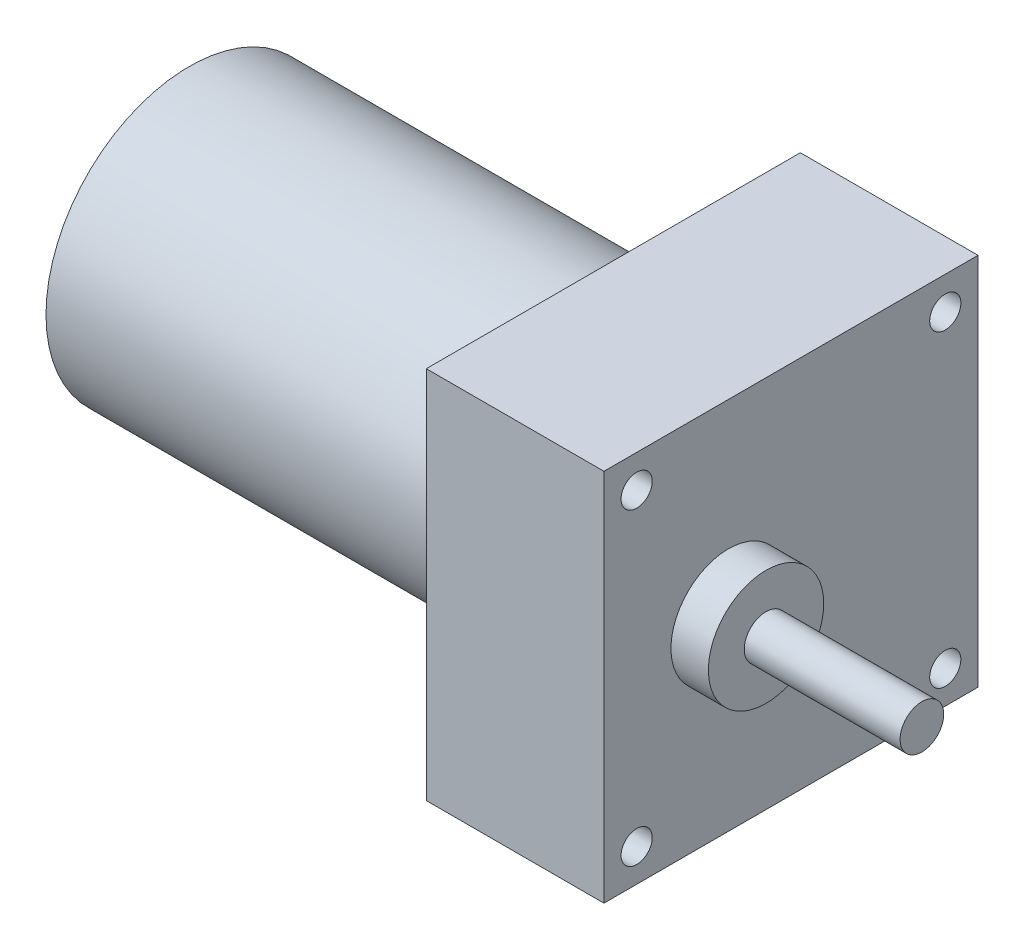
ISO-10303-21;
HEADER;
FILE_DESCRIPTION(('STEP AP214'),'2;1');
FILE_NAME('part.step','',(''),(''),'','','');
FILE_SCHEMA(('AUTOMOTIVE_DESIGN { 1 0 10303 214 1 1 1 1 }'));
ENDSEC;
DATA;
#1=APPLICATION_CONTEXT('core data for automotive mechanical design processes');
#2=APPLICATION_PROTOCOL_DEFINITION('international standard','automotive_design',2000,#1);
#3=PRODUCT_CONTEXT('',#1,'mechanical');
#4=PRODUCT('Part','Part','',(#3));
#5=PRODUCT_RELATED_PRODUCT_CATEGORY('part','',(#4));
#6=PRODUCT_DEFINITION_FORMATION('','',#4);
#7=PRODUCT_DEFINITION_CONTEXT('part definition',#1,'design');
#8=PRODUCT_DEFINITION('design','',#6,#7);
#9=PRODUCT_DEFINITION_SHAPE('','',#8);
#10=(LENGTH_UNIT() NAMED_UNIT(*) SI_UNIT(.MILLI.,.METRE.));
#11=(NAMED_UNIT(*) PLANE_ANGLE_UNIT() SI_UNIT($,.RADIAN.));
#12=(NAMED_UNIT(*) SI_UNIT($,.STERADIAN.) SOLID_ANGLE_UNIT());
#13=UNCERTAINTY_MEASURE_WITH_UNIT(LENGTH_MEASURE(1.E-05),#10,'distance_accuracy_value','');
#14=(GEOMETRIC_REPRESENTATION_CONTEXT(3) GLOBAL_UNCERTAINTY_ASSIGNED_CONTEXT((#13)) GLOBAL_UNIT_ASSIGNED_CONTEXT((#10,
#11,#12)) REPRESENTATION_CONTEXT('',''));
#15=CARTESIAN_POINT('',(0.,0.,0.));
#16=DIRECTION('',(0.,0.,1.));
#17=DIRECTION('',(1.,0.,0.));
#18=AXIS2_PLACEMENT_3D('',#15,#16,#17);
#19=CARTESIAN_POINT('',(59.5,0.,10.));
#20=DIRECTION('',(-1.,0.,0.));
#21=DIRECTION('',(0.,0.,1.));
#22=AXIS2_PLACEMENT_3D('',#19,#20,#21);
#23=CYLINDRICAL_SURFACE('',#22,3.5);
#24=CARTESIAN_POINT('',(59.5,0.,10.));
#25=DIRECTION('',(1.,0.,0.));
#26=DIRECTION('',(0.,0.,-1.));
#27=AXIS2_PLACEMENT_3D('',#24,#25,#26);
#28=CIRCLE('',#27,3.5);
#29=CARTESIAN_POINT('',(59.5,0.,6.5));
#30=VERTEX_POINT('',#29);
#31=EDGE_CURVE('E12',#30,#30,#28,.T.);
#32=ORIENTED_EDGE('',*,*,#31,.F.);
#33=EDGE_LOOP('',(#32));
#34=FACE_BOUND('',#33,.T.);
#35=CARTESIAN_POINT('',(34.5,0.,10.));
#36=DIRECTION('',(1.,0.,0.));
#37=DIRECTION('',(0.,0.,-1.));
#38=AXIS2_PLACEMENT_3D('',#35,#36,#37);
#39=CIRCLE('',#38,3.5);
#40=CARTESIAN_POINT('',(34.5,0.,6.5));
#41=VERTEX_POINT('',#40);
#42=EDGE_CURVE('E58',#41,#41,#39,.T.);
#43=ORIENTED_EDGE('',*,*,#42,.T.);
#44=EDGE_LOOP('',(#43));
#45=FACE_BOUND('',#44,.T.);
#46=ADVANCED_FACE('F55',(#34,#45),#23,.T.);
#47=CARTESIAN_POINT('',(59.5,0.,10.));
#48=DIRECTION('',(1.,0.,0.));
#49=DIRECTION('',(0.,0.,-1.));
#50=AXIS2_PLACEMENT_3D('',#47,#48,#49);
#51=PLANE('',#50);
#52=ORIENTED_EDGE('',*,*,#31,.T.);
#53=EDGE_LOOP('',(#52));
#54=FACE_BOUND('',#53,.T.);
#55=ADVANCED_FACE('F70',(#54),#51,.T.);
#56=CARTESIAN_POINT('',(34.5,0.,10.));
#57=DIRECTION('',(1.,0.,0.));
#58=DIRECTION('',(0.,0.,-1.));
#59=AXIS2_PLACEMENT_3D('',#56,#57,#58);
#60=PLANE('',#59);
#61=ORIENTED_EDGE('',*,*,#42,.F.);
#62=EDGE_LOOP('',(#61));
#63=FACE_BOUND('',#62,.T.);
#64=ADVANCED_FACE('F68',(#63),#60,.F.);
#65=CLOSED_SHELL('',(#46,#55,#64));
#66=MANIFOLD_SOLID_BREP('B2',#65);
#67=CARTESIAN_POINT('',(28.5,0.,-30.));
#68=DIRECTION('',(0.,0.,1.));
#69=DIRECTION('',(1.,0.,0.));
#70=AXIS2_PLACEMENT_3D('',#67,#68,#69);
#71=PLANE('',#70);
#72=DIRECTION('',(0.,1.,0.));
#73=VECTOR('',#72,1.);
#74=CARTESIAN_POINT('',(0.,0.,-30.));
#75=LINE('',#74,#73);
#76=CARTESIAN_POINT('',(0.,-30.,-30.));
#77=VERTEX_POINT('',#76);
#78=CARTESIAN_POINT('',(0.,30.,-30.));
#79=VERTEX_POINT('',#78);
#80=EDGE_CURVE('E178',#77,#79,#75,.T.);
#81=ORIENTED_EDGE('',*,*,#80,.T.);
#82=DIRECTION('',(-1.,0.,0.));
#83=VECTOR('',#82,1.);
#84=CARTESIAN_POINT('',(28.5,30.,-30.));
#85=LINE('',#84,#83);
#86=CARTESIAN_POINT('',(28.5,30.,-30.));
#87=VERTEX_POINT('',#86);
#88=EDGE_CURVE('E157',#87,#79,#85,.T.);
#89=ORIENTED_EDGE('',*,*,#88,.F.);
#90=DIRECTION('',(0.,1.,0.));
#91=VECTOR('',#90,1.);
#92=CARTESIAN_POINT('',(28.5,0.,-30.));
#93=LINE('',#92,#91);
#94=CARTESIAN_POINT('',(28.5,-30.,-30.));
#95=VERTEX_POINT('',#94);
#96=EDGE_CURVE('E148',#95,#87,#93,.T.);
#97=ORIENTED_EDGE('',*,*,#96,.F.);
#98=DIRECTION('',(-1.,0.,0.));
#99=VECTOR('',#98,1.);
#100=CARTESIAN_POINT('',(28.5,-30.,-30.));
#101=LINE('',#100,#99);
#102=EDGE_CURVE('E113',#95,#77,#101,.T.);
#103=ORIENTED_EDGE('',*,*,#102,.T.);
#104=EDGE_LOOP('',(#81,#89,#97,#103));
#105=FACE_BOUND('',#104,.T.);
#106=ADVANCED_FACE('F96',(#105),#71,.F.);
#107=CARTESIAN_POINT('',(28.5,30.,0.));
#108=DIRECTION('',(0.,-1.,0.));
#109=DIRECTION('',(0.,0.,-1.));
#110=AXIS2_PLACEMENT_3D('',#107,#108,#109);
#111=PLANE('',#110);
#112=DIRECTION('',(0.,0.,1.));
#113=VECTOR('',#112,1.);
#114=CARTESIAN_POINT('',(0.,30.,0.));
#115=LINE('',#114,#113);
#116=CARTESIAN_POINT('',(0.,30.,30.));
#117=VERTEX_POINT('',#116);
#118=EDGE_CURVE('E154',#79,#117,#115,.T.);
#119=ORIENTED_EDGE('',*,*,#118,.T.);
#120=DIRECTION('',(-1.,0.,0.));
#121=VECTOR('',#120,1.);
#122=CARTESIAN_POINT('',(28.5,30.,30.));
#123=LINE('',#122,#121);
#124=CARTESIAN_POINT('',(28.5,30.,30.));
#125=VERTEX_POINT('',#124);
#126=EDGE_CURVE('E152',#125,#117,#123,.T.);
#127=ORIENTED_EDGE('',*,*,#126,.F.);
#128=DIRECTION('',(0.,0.,1.));
#129=VECTOR('',#128,1.);
#130=CARTESIAN_POINT('',(28.5,30.,0.));
#131=LINE('',#130,#129);
#132=EDGE_CURVE('E139',#87,#125,#131,.T.);
#133=ORIENTED_EDGE('',*,*,#132,.F.);
#134=ORIENTED_EDGE('',*,*,#88,.T.);
#135=EDGE_LOOP('',(#119,#127,#133,#134));
#136=FACE_BOUND('',#135,.T.);
#137=ADVANCED_FACE('F153',(#136),#111,.F.);
#138=CARTESIAN_POINT('',(28.5,0.,30.));
#139=DIRECTION('',(0.,0.,1.));
#140=DIRECTION('',(1.,0.,0.));
#141=AXIS2_PLACEMENT_3D('',#138,#139,#140);
#142=PLANE('',#141);
#143=DIRECTION('',(0.,1.,0.));
#144=VECTOR('',#143,1.);
#145=CARTESIAN_POINT('',(0.,0.,30.));
#146=LINE('',#145,#144);
#147=CARTESIAN_POINT('',(0.,-30.,30.));
#148=VERTEX_POINT('',#147);
#149=EDGE_CURVE('E181',#148,#117,#146,.T.);
#150=ORIENTED_EDGE('',*,*,#149,.F.);
#151=DIRECTION('',(-1.,0.,0.));
#152=VECTOR('',#151,1.);
#153=CARTESIAN_POINT('',(28.5,-30.,30.));
#154=LINE('',#153,#152);
#155=CARTESIAN_POINT('',(28.5,-30.,30.));
#156=VERTEX_POINT('',#155);
#157=EDGE_CURVE('E127',#156,#148,#154,.T.);
#158=ORIENTED_EDGE('',*,*,#157,.F.);
#159=DIRECTION('',(0.,1.,0.));
#160=VECTOR('',#159,1.);
#161=CARTESIAN_POINT('',(28.5,0.,30.));
#162=LINE('',#161,#160);
#163=EDGE_CURVE('E147',#156,#125,#162,.T.);
#164=ORIENTED_EDGE('',*,*,#163,.T.);
#165=ORIENTED_EDGE('',*,*,#126,.T.);
#166=EDGE_LOOP('',(#150,#158,#164,#165));
#167=FACE_BOUND('',#166,.T.);
#168=ADVANCED_FACE('F159',(#167),#142,.T.);
#169=CARTESIAN_POINT('',(28.5,24.75,-24.75));
#170=DIRECTION('',(-1.,0.,0.));
#171=DIRECTION('',(0.,0.,1.));
#172=AXIS2_PLACEMENT_3D('',#169,#170,#171);
#173=CYLINDRICAL_SURFACE('',#172,2.5);
#174=CARTESIAN_POINT('',(28.5,24.75,-24.75));
#175=DIRECTION('',(1.,0.,0.));
#176=DIRECTION('',(0.,0.,-1.));
#177=AXIS2_PLACEMENT_3D('',#174,#175,#176);
#178=CIRCLE('',#177,2.5);
#179=CARTESIAN_POINT('',(28.5,24.75,-22.25));
#180=VERTEX_POINT('',#179);
#181=EDGE_CURVE('E162',#180,#180,#178,.T.);
#182=CARTESIAN_POINT('',(0.,24.75,-24.75));
#183=DIRECTION('',(1.,0.,0.));
#184=DIRECTION('',(0.,0.,-1.));
#185=AXIS2_PLACEMENT_3D('',#182,#183,#184);
#186=CIRCLE('',#185,2.5);
#187=CARTESIAN_POINT('',(0.,24.75,-22.25));
#188=VERTEX_POINT('',#187);
#189=EDGE_CURVE('E186',#188,#188,#186,.T.);
#190=CARTESIAN_POINT('',(28.5,24.75,-22.25));
#191=CARTESIAN_POINT('',(28.203125,24.75,-22.25));
#192=CARTESIAN_POINT('',(27.90625,24.75,-22.25));
#193=CARTESIAN_POINT('',(27.3125,24.75,-22.25));
#194=CARTESIAN_POINT('',(27.015625,24.75,-22.25));
#195=CARTESIAN_POINT('',(26.421875,24.75,-22.25));
#196=CARTESIAN_POINT('',(26.125,24.75,-22.25));
#197=CARTESIAN_POINT('',(25.53125,24.75,-22.25));
#198=CARTESIAN_POINT('',(25.234375,24.75,-22.25));
#199=CARTESIAN_POINT('',(24.640625,24.75,-22.25));
#200=CARTESIAN_POINT('',(24.34375,24.75,-22.25));
#201=CARTESIAN_POINT('',(23.75,24.75,-22.25));
#202=CARTESIAN_POINT('',(23.453125,24.75,-22.25));
#203=CARTESIAN_POINT('',(22.859375,24.75,-22.25));
#204=CARTESIAN_POINT('',(22.5625,24.75,-22.25));
#205=CARTESIAN_POINT('',(21.96875,24.75,-22.25));
#206=CARTESIAN_POINT('',(21.671875,24.75,-22.25));
#207=CARTESIAN_POINT('',(21.078125,24.75,-22.25));
#208=CARTESIAN_POINT('',(20.78125,24.75,-22.25));
#209=CARTESIAN_POINT('',(20.1875,24.75,-22.25));
#210=CARTESIAN_POINT('',(19.890625,24.75,-22.25));
#211=CARTESIAN_POINT('',(19.296875,24.75,-22.25));
#212=CARTESIAN_POINT('',(19.,24.75,-22.25));
#213=CARTESIAN_POINT('',(18.40625,24.75,-22.25));
#214=CARTESIAN_POINT('',(18.109375,24.75,-22.25));
#215=CARTESIAN_POINT('',(17.515625,24.75,-22.25));
#216=CARTESIAN_POINT('',(17.21875,24.75,-22.25));
#217=CARTESIAN_POINT('',(16.625,24.75,-22.25));
#218=CARTESIAN_POINT('',(16.328125,24.75,-22.25));
#219=CARTESIAN_POINT('',(15.734375,24.75,-22.25));
#220=CARTESIAN_POINT('',(15.4375,24.75,-22.25));
#221=CARTESIAN_POINT('',(14.84375,24.75,-22.25));
#222=CARTESIAN_POINT('',(14.546875,24.75,-22.25));
#223=CARTESIAN_POINT('',(13.953125,24.75,-22.25));
#224=CARTESIAN_POINT('',(13.65625,24.75,-22.25));
#225=CARTESIAN_POINT('',(13.0625,24.75,-22.25));
#226=CARTESIAN_POINT('',(12.765625,24.75,-22.25));
#227=CARTESIAN_POINT('',(12.171875,24.75,-22.25));
#228=CARTESIAN_POINT('',(11.875,24.75,-22.25));
#229=CARTESIAN_POINT('',(11.28125,24.75,-22.25));
#230=CARTESIAN_POINT('',(10.984375,24.75,-22.25));
#231=CARTESIAN_POINT('',(10.390625,24.75,-22.25));
#232=CARTESIAN_POINT('',(10.09375,24.75,-22.25));
#233=CARTESIAN_POINT('',(9.5,24.75,-22.25));
#234=CARTESIAN_POINT('',(9.203125,24.75,-22.25));
#235=CARTESIAN_POINT('',(8.609375,24.75,-22.25));
#236=CARTESIAN_POINT('',(8.3125,24.75,-22.25));
#237=CARTESIAN_POINT('',(7.71875,24.75,-22.25));
#238=CARTESIAN_POINT('',(7.421875,24.75,-22.25));
#239=CARTESIAN_POINT('',(6.828125,24.75,-22.25));
#240=CARTESIAN_POINT('',(6.53125,24.75,-22.25));
#241=CARTESIAN_POINT('',(5.9375,24.75,-22.25));
#242=CARTESIAN_POINT('',(5.640625,24.75,-22.25));
#243=CARTESIAN_POINT('',(5.046875,24.75,-22.25));
#244=CARTESIAN_POINT('',(4.75,24.75,-22.25));
#245=CARTESIAN_POINT('',(4.15625,24.75,-22.25));
#246=CARTESIAN_POINT('',(3.859375,24.75,-22.25));
#247=CARTESIAN_POINT('',(3.265625,24.75,-22.25));
#248=CARTESIAN_POINT('',(2.96875,24.75,-22.25));
#249=CARTESIAN_POINT('',(2.375,24.75,-22.25));
#250=CARTESIAN_POINT('',(2.078125,24.75,-22.25));
#251=CARTESIAN_POINT('',(1.484375,24.75,-22.25));
#252=CARTESIAN_POINT('',(1.1875,24.75,-22.25));
#253=CARTESIAN_POINT('',(0.593749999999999,24.75,-22.25));
#254=CARTESIAN_POINT('',(0.296875,24.75,-22.25));
#255=CARTESIAN_POINT('',(0.,24.75,-22.25));
#256=B_SPLINE_CURVE_WITH_KNOTS('',3,(#190,#191,#192,#193,#194,#195,#196,#197,#198,#199,#200,
#201,#202,#203,#204,#205,#206,#207,#208,#209,#210,#211,#212,#213,#214,#215,#216,#217,#218,#219,
#220,#221,#222,#223,#224,#225,#226,#227,#228,#229,#230,#231,#232,#233,#234,#235,#236,#237,#238,
#239,#240,#241,#242,#243,#244,#245,#246,#247,#248,#249,#250,#251,#252,#253,#254,#255),
.UNSPECIFIED.,.F.,.F.,(4,2,2,2,2,2,2,2,2,2,2,2,2,2,2,2,2,2,2,2,2,2,2,2,2,2,2,2,2,2,2,2,4),(0.,
0.890624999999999,1.78125,2.671875,3.5625,4.453125,5.34375,6.234375,7.125,8.015625,8.90625,
9.796875,10.6875,11.578125,12.46875,13.359375,14.25,15.140625,16.03125,16.921875,17.8125,
18.703125,19.59375,20.484375,21.375,22.265625,23.15625,24.046875,24.9375,25.828125,26.71875,
27.609375,28.5),.UNSPECIFIED.);
#257=EDGE_CURVE('BSEAM237',#180,#188,#256,.T.);
#258=ORIENTED_EDGE('',*,*,#181,.T.);
#259=ORIENTED_EDGE('',*,*,#189,.F.);
#260=ORIENTED_EDGE('',*,*,#257,.T.);
#261=ORIENTED_EDGE('',*,*,#257,.F.);
#262=EDGE_LOOP('',(#258,#260,#259,#261));
#263=FACE_BOUND('',#262,.T.);
#264=ADVANCED_FACE('F237',(#263),#173,.F.);
#265=CARTESIAN_POINT('',(28.5,-30.,0.));
#266=DIRECTION('',(0.,-1.,0.));
#267=DIRECTION('',(0.,0.,-1.));
#268=AXIS2_PLACEMENT_3D('',#265,#266,#267);
#269=PLANE('',#268);
#270=DIRECTION('',(0.,0.,1.));
#271=VECTOR('',#270,1.);
#272=CARTESIAN_POINT('',(0.,-30.,0.));
#273=LINE('',#272,#271);
#274=EDGE_CURVE('E183',#77,#148,#273,.T.);
#275=ORIENTED_EDGE('',*,*,#274,.F.);
#276=ORIENTED_EDGE('',*,*,#102,.F.);
#277=DIRECTION('',(0.,0.,1.));
#278=VECTOR('',#277,1.);
#279=CARTESIAN_POINT('',(28.5,-30.,0.));
#280=LINE('',#279,#278);
#281=EDGE_CURVE('E160',#95,#156,#280,.T.);
#282=ORIENTED_EDGE('',*,*,#281,.T.);
#283=ORIENTED_EDGE('',*,*,#157,.T.);
#284=EDGE_LOOP('',(#275,#276,#282,#283));
#285=FACE_BOUND('',#284,.T.);
#286=ADVANCED_FACE('F230',(#285),#269,.T.);
#287=CARTESIAN_POINT('',(28.5,-24.75,24.75));
#288=DIRECTION('',(-1.,0.,0.));
#289=DIRECTION('',(0.,0.,1.));
#290=AXIS2_PLACEMENT_3D('',#287,#288,#289);
#291=CYLINDRICAL_SURFACE('',#290,2.5);
#292=CARTESIAN_POINT('',(28.5,-24.75,24.75));
#293=DIRECTION('',(1.,0.,0.));
#294=DIRECTION('',(0.,0.,-1.));
#295=AXIS2_PLACEMENT_3D('',#292,#293,#294);
#296=CIRCLE('',#295,2.5);
#297=CARTESIAN_POINT('',(28.5,-24.75,27.25));
#298=VERTEX_POINT('',#297);
#299=EDGE_CURVE('E242',#298,#298,#296,.T.);
#300=CARTESIAN_POINT('',(0.,-24.75,24.75));
#301=DIRECTION('',(1.,0.,0.));
#302=DIRECTION('',(0.,0.,-1.));
#303=AXIS2_PLACEMENT_3D('',#300,#301,#302);
#304=CIRCLE('',#303,2.5);
#305=CARTESIAN_POINT('',(0.,-24.75,27.25));
#306=VERTEX_POINT('',#305);
#307=EDGE_CURVE('E174',#306,#306,#304,.T.);
#308=CARTESIAN_POINT('',(28.5,-24.75,27.25));
#309=CARTESIAN_POINT('',(28.203125,-24.75,27.25));
#310=CARTESIAN_POINT('',(27.90625,-24.75,27.25));
#311=CARTESIAN_POINT('',(27.3125,-24.75,27.25));
#312=CARTESIAN_POINT('',(27.015625,-24.75,27.25));
#313=CARTESIAN_POINT('',(26.421875,-24.75,27.25));
#314=CARTESIAN_POINT('',(26.125,-24.75,27.25));
#315=CARTESIAN_POINT('',(25.53125,-24.75,27.25));
#316=CARTESIAN_POINT('',(25.234375,-24.75,27.25));
#317=CARTESIAN_POINT('',(24.640625,-24.75,27.25));
#318=CARTESIAN_POINT('',(24.34375,-24.75,27.25));
#319=CARTESIAN_POINT('',(23.75,-24.75,27.25));
#320=CARTESIAN_POINT('',(23.453125,-24.75,27.25));
#321=CARTESIAN_POINT('',(22.859375,-24.75,27.25));
#322=CARTESIAN_POINT('',(22.5625,-24.75,27.25));
#323=CARTESIAN_POINT('',(21.96875,-24.75,27.25));
#324=CARTESIAN_POINT('',(21.671875,-24.75,27.25));
#325=CARTESIAN_POINT('',(21.078125,-24.75,27.25));
#326=CARTESIAN_POINT('',(20.78125,-24.75,27.25));
#327=CARTESIAN_POINT('',(20.1875,-24.75,27.25));
#328=CARTESIAN_POINT('',(19.890625,-24.75,27.25));
#329=CARTESIAN_POINT('',(19.296875,-24.75,27.25));
#330=CARTESIAN_POINT('',(19.,-24.75,27.25));
#331=CARTESIAN_POINT('',(18.40625,-24.75,27.25));
#332=CARTESIAN_POINT('',(18.109375,-24.75,27.25));
#333=CARTESIAN_POINT('',(17.515625,-24.75,27.25));
#334=CARTESIAN_POINT('',(17.21875,-24.75,27.25));
#335=CARTESIAN_POINT('',(16.625,-24.75,27.25));
#336=CARTESIAN_POINT('',(16.328125,-24.75,27.25));
#337=CARTESIAN_POINT('',(15.734375,-24.75,27.25));
#338=CARTESIAN_POINT('',(15.4375,-24.75,27.25));
#339=CARTESIAN_POINT('',(14.84375,-24.75,27.25));
#340=CARTESIAN_POINT('',(14.546875,-24.75,27.25));
#341=CARTESIAN_POINT('',(13.953125,-24.75,27.25));
#342=CARTESIAN_POINT('',(13.65625,-24.75,27.25));
#343=CARTESIAN_POINT('',(13.0625,-24.75,27.25));
#344=CARTESIAN_POINT('',(12.765625,-24.75,27.25));
#345=CARTESIAN_POINT('',(12.171875,-24.75,27.25));
#346=CARTESIAN_POINT('',(11.875,-24.75,27.25));
#347=CARTESIAN_POINT('',(11.28125,-24.75,27.25));
#348=CARTESIAN_POINT('',(10.984375,-24.75,27.25));
#349=CARTESIAN_POINT('',(10.390625,-24.75,27.25));
#350=CARTESIAN_POINT('',(10.09375,-24.75,27.25));
#351=CARTESIAN_POINT('',(9.5,-24.75,27.25));
#352=CARTESIAN_POINT('',(9.203125,-24.75,27.25));
#353=CARTESIAN_POINT('',(8.609375,-24.75,27.25));
#354=CARTESIAN_POINT('',(8.3125,-24.75,27.25));
#355=CARTESIAN_POINT('',(7.71875,-24.75,27.25));
#356=CARTESIAN_POINT('',(7.421875,-24.75,27.25));
#357=CARTESIAN_POINT('',(6.828125,-24.75,27.25));
#358=CARTESIAN_POINT('',(6.53125,-24.75,27.25));
#359=CARTESIAN_POINT('',(5.9375,-24.75,27.25));
#360=CARTESIAN_POINT('',(5.640625,-24.75,27.25));
#361=CARTESIAN_POINT('',(5.046875,-24.75,27.25));
#362=CARTESIAN_POINT('',(4.75,-24.75,27.25));
#363=CARTESIAN_POINT('',(4.15625,-24.75,27.25));
#364=CARTESIAN_POINT('',(3.859375,-24.75,27.25));
#365=CARTESIAN_POINT('',(3.265625,-24.75,27.25));
#366=CARTESIAN_POINT('',(2.96875,-24.75,27.25));
#367=CARTESIAN_POINT('',(2.375,-24.75,27.25));
#368=CARTESIAN_POINT('',(2.078125,-24.75,27.25));
#369=CARTESIAN_POINT('',(1.484375,-24.75,27.25));
#370=CARTESIAN_POINT('',(1.1875,-24.75,27.25));
#371=CARTESIAN_POINT('',(0.593749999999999,-24.75,27.25));
#372=CARTESIAN_POINT('',(0.296875,-24.75,27.25));
#373=CARTESIAN_POINT('',(0.,-24.75,27.25));
#374=B_SPLINE_CURVE_WITH_KNOTS('',3,(#308,#309,#310,#311,#312,#313,#314,#315,#316,#317,#318,
#319,#320,#321,#322,#323,#324,#325,#326,#327,#328,#329,#330,#331,#332,#333,#334,#335,#336,#337,
#338,#339,#340,#341,#342,#343,#344,#345,#346,#347,#348,#349,#350,#351,#352,#353,#354,#355,#356,
#357,#358,#359,#360,#361,#362,#363,#364,#365,#366,#367,#368,#369,#370,#371,#372,#373),
.UNSPECIFIED.,.F.,.F.,(4,2,2,2,2,2,2,2,2,2,2,2,2,2,2,2,2,2,2,2,2,2,2,2,2,2,2,2,2,2,2,2,4),(0.,
0.890624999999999,1.78125,2.671875,3.5625,4.453125,5.34375,6.234375,7.125,8.015625,8.90625,
9.796875,10.6875,11.578125,12.46875,13.359375,14.25,15.140625,16.03125,16.921875,17.8125,
18.703125,19.59375,20.484375,21.375,22.265625,23.15625,24.046875,24.9375,25.828125,26.71875,
27.609375,28.5),.UNSPECIFIED.);
#375=EDGE_CURVE('BSEAM228',#298,#306,#374,.T.);
#376=ORIENTED_EDGE('',*,*,#299,.T.);
#377=ORIENTED_EDGE('',*,*,#307,.F.);
#378=ORIENTED_EDGE('',*,*,#375,.T.);
#379=ORIENTED_EDGE('',*,*,#375,.F.);
#380=EDGE_LOOP('',(#376,#378,#377,#379));
#381=FACE_BOUND('',#380,.T.);
#382=ADVANCED_FACE('F228',(#381),#291,.F.);
#383=CARTESIAN_POINT('',(28.5,24.75,24.75));
#384=DIRECTION('',(-1.,0.,0.));
#385=DIRECTION('',(0.,0.,1.));
#386=AXIS2_PLACEMENT_3D('',#383,#384,#385);
#387=CYLINDRICAL_SURFACE('',#386,2.5);
#388=CARTESIAN_POINT('',(28.5,24.75,24.75));
#389=DIRECTION('',(1.,0.,0.));
#390=DIRECTION('',(0.,0.,-1.));
#391=AXIS2_PLACEMENT_3D('',#388,#389,#390);
#392=CIRCLE('',#391,2.5);
#393=CARTESIAN_POINT('',(28.5,24.75,27.25));
#394=VERTEX_POINT('',#393);
#395=EDGE_CURVE('E192',#394,#394,#392,.F.);
#396=CARTESIAN_POINT('',(0.,24.75,24.75));
#397=DIRECTION('',(1.,0.,0.));
#398=DIRECTION('',(0.,0.,-1.));
#399=AXIS2_PLACEMENT_3D('',#396,#397,#398);
#400=CIRCLE('',#399,2.5);
#401=CARTESIAN_POINT('',(0.,24.75,27.25));
#402=VERTEX_POINT('',#401);
#403=EDGE_CURVE('E171',#402,#402,#400,.F.);
#404=CARTESIAN_POINT('',(28.5,24.75,27.25));
#405=CARTESIAN_POINT('',(28.203125,24.75,27.25));
#406=CARTESIAN_POINT('',(27.90625,24.75,27.25));
#407=CARTESIAN_POINT('',(27.3125,24.75,27.25));
#408=CARTESIAN_POINT('',(27.015625,24.75,27.25));
#409=CARTESIAN_POINT('',(26.421875,24.75,27.25));
#410=CARTESIAN_POINT('',(26.125,24.75,27.25));
#411=CARTESIAN_POINT('',(25.53125,24.75,27.25));
#412=CARTESIAN_POINT('',(25.234375,24.75,27.25));
#413=CARTESIAN_POINT('',(24.640625,24.75,27.25));
#414=CARTESIAN_POINT('',(24.34375,24.75,27.25));
#415=CARTESIAN_POINT('',(23.75,24.75,27.25));
#416=CARTESIAN_POINT('',(23.453125,24.75,27.25));
#417=CARTESIAN_POINT('',(22.859375,24.75,27.25));
#418=CARTESIAN_POINT('',(22.5625,24.75,27.25));
#419=CARTESIAN_POINT('',(21.96875,24.75,27.25));
#420=CARTESIAN_POINT('',(21.671875,24.75,27.25));
#421=CARTESIAN_POINT('',(21.078125,24.75,27.25));
#422=CARTESIAN_POINT('',(20.78125,24.75,27.25));
#423=CARTESIAN_POINT('',(20.1875,24.75,27.25));
#424=CARTESIAN_POINT('',(19.890625,24.75,27.25));
#425=CARTESIAN_POINT('',(19.296875,24.75,27.25));
#426=CARTESIAN_POINT('',(19.,24.75,27.25));
#427=CARTESIAN_POINT('',(18.40625,24.75,27.25));
#428=CARTESIAN_POINT('',(18.109375,24.75,27.25));
#429=CARTESIAN_POINT('',(17.515625,24.75,27.25));
#430=CARTESIAN_POINT('',(17.21875,24.75,27.25));
#431=CARTESIAN_POINT('',(16.625,24.75,27.25));
#432=CARTESIAN_POINT('',(16.328125,24.75,27.25));
#433=CARTESIAN_POINT('',(15.734375,24.75,27.25));
#434=CARTESIAN_POINT('',(15.4375,24.75,27.25));
#435=CARTESIAN_POINT('',(14.84375,24.75,27.25));
#436=CARTESIAN_POINT('',(14.546875,24.75,27.25));
#437=CARTESIAN_POINT('',(13.953125,24.75,27.25));
#438=CARTESIAN_POINT('',(13.65625,24.75,27.25));
#439=CARTESIAN_POINT('',(13.0625,24.75,27.25));
#440=CARTESIAN_POINT('',(12.765625,24.75,27.25));
#441=CARTESIAN_POINT('',(12.171875,24.75,27.25));
#442=CARTESIAN_POINT('',(11.875,24.75,27.25));
#443=CARTESIAN_POINT('',(11.28125,24.75,27.25));
#444=CARTESIAN_POINT('',(10.984375,24.75,27.25));
#445=CARTESIAN_POINT('',(10.390625,24.75,27.25));
#446=CARTESIAN_POINT('',(10.09375,24.75,27.25));
#447=CARTESIAN_POINT('',(9.5,24.75,27.25));
#448=CARTESIAN_POINT('',(9.203125,24.75,27.25));
#449=CARTESIAN_POINT('',(8.609375,24.75,27.25));
#450=CARTESIAN_POINT('',(8.3125,24.75,27.25));
#451=CARTESIAN_POINT('',(7.71875,24.75,27.25));
#452=CARTESIAN_POINT('',(7.421875,24.75,27.25));
#453=CARTESIAN_POINT('',(6.828125,24.75,27.25));
#454=CARTESIAN_POINT('',(6.53125,24.75,27.25));
#455=CARTESIAN_POINT('',(5.9375,24.75,27.25));
#456=CARTESIAN_POINT('',(5.640625,24.75,27.25));
#457=CARTESIAN_POINT('',(5.046875,24.75,27.25));
#458=CARTESIAN_POINT('',(4.75,24.75,27.25));
#459=CARTESIAN_POINT('',(4.15625,24.75,27.25));
#460=CARTESIAN_POINT('',(3.859375,24.75,27.25));
#461=CARTESIAN_POINT('',(3.265625,24.75,27.25));
#462=CARTESIAN_POINT('',(2.96875,24.75,27.25));
#463=CARTESIAN_POINT('',(2.375,24.75,27.25));
#464=CARTESIAN_POINT('',(2.078125,24.75,27.25));
#465=CARTESIAN_POINT('',(1.484375,24.75,27.25));
#466=CARTESIAN_POINT('',(1.1875,24.75,27.25));
#467=CARTESIAN_POINT('',(0.593749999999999,24.75,27.25));
#468=CARTESIAN_POINT('',(0.296875,24.75,27.25));
#469=CARTESIAN_POINT('',(0.,24.75,27.25));
#470=B_SPLINE_CURVE_WITH_KNOTS('',3,(#404,#405,#406,#407,#408,#409,#410,#411,#412,#413,#414,
#415,#416,#417,#418,#419,#420,#421,#422,#423,#424,#425,#426,#427,#428,#429,#430,#431,#432,#433,
#434,#435,#436,#437,#438,#439,#440,#441,#442,#443,#444,#445,#446,#447,#448,#449,#450,#451,#452,
#453,#454,#455,#456,#457,#458,#459,#460,#461,#462,#463,#464,#465,#466,#467,#468,#469),
.UNSPECIFIED.,.F.,.F.,(4,2,2,2,2,2,2,2,2,2,2,2,2,2,2,2,2,2,2,2,2,2,2,2,2,2,2,2,2,2,2,2,4),(0.,
0.890624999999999,1.78125,2.671875,3.5625,4.453125,5.34375,6.234375,7.125,8.015625,8.90625,
9.796875,10.6875,11.578125,12.46875,13.359375,14.25,15.140625,16.03125,16.921875,17.8125,
18.703125,19.59375,20.484375,21.375,22.265625,23.15625,24.046875,24.9375,25.828125,26.71875,
27.609375,28.5),.UNSPECIFIED.);
#471=EDGE_CURVE('BSEAM98',#394,#402,#470,.T.);
#472=ORIENTED_EDGE('',*,*,#395,.F.);
#473=ORIENTED_EDGE('',*,*,#403,.T.);
#474=ORIENTED_EDGE('',*,*,#471,.T.);
#475=ORIENTED_EDGE('',*,*,#471,.F.);
#476=EDGE_LOOP('',(#472,#474,#473,#475));
#477=FACE_BOUND('',#476,.T.);
#478=ADVANCED_FACE('F98',(#477),#387,.F.);
#479=CARTESIAN_POINT('',(28.5,-24.75,-24.75));
#480=DIRECTION('',(-1.,0.,0.));
#481=DIRECTION('',(0.,0.,1.));
#482=AXIS2_PLACEMENT_3D('',#479,#480,#481);
#483=CYLINDRICAL_SURFACE('',#482,2.5);
#484=CARTESIAN_POINT('',(28.5,-24.75,-24.75));
#485=DIRECTION('',(1.,0.,0.));
#486=DIRECTION('',(0.,0.,-1.));
#487=AXIS2_PLACEMENT_3D('',#484,#485,#486);
#488=CIRCLE('',#487,2.5);
#489=CARTESIAN_POINT('',(28.5,-24.75,-22.25));
#490=VERTEX_POINT('',#489);
#491=EDGE_CURVE('E168',#490,#490,#488,.F.);
#492=CARTESIAN_POINT('',(0.,-24.75,-24.75));
#493=DIRECTION('',(1.,0.,0.));
#494=DIRECTION('',(0.,0.,-1.));
#495=AXIS2_PLACEMENT_3D('',#492,#493,#494);
#496=CIRCLE('',#495,2.5);
#497=CARTESIAN_POINT('',(0.,-24.75,-22.25));
#498=VERTEX_POINT('',#497);
#499=EDGE_CURVE('E189',#498,#498,#496,.F.);
#500=CARTESIAN_POINT('',(28.5,-24.75,-22.25));
#501=CARTESIAN_POINT('',(28.203125,-24.75,-22.25));
#502=CARTESIAN_POINT('',(27.90625,-24.75,-22.25));
#503=CARTESIAN_POINT('',(27.3125,-24.75,-22.25));
#504=CARTESIAN_POINT('',(27.015625,-24.75,-22.25));
#505=CARTESIAN_POINT('',(26.421875,-24.75,-22.25));
#506=CARTESIAN_POINT('',(26.125,-24.75,-22.25));
#507=CARTESIAN_POINT('',(25.53125,-24.75,-22.25));
#508=CARTESIAN_POINT('',(25.234375,-24.75,-22.25));
#509=CARTESIAN_POINT('',(24.640625,-24.75,-22.25));
#510=CARTESIAN_POINT('',(24.34375,-24.75,-22.25));
#511=CARTESIAN_POINT('',(23.75,-24.75,-22.25));
#512=CARTESIAN_POINT('',(23.453125,-24.75,-22.25));
#513=CARTESIAN_POINT('',(22.859375,-24.75,-22.25));
#514=CARTESIAN_POINT('',(22.5625,-24.75,-22.25));
#515=CARTESIAN_POINT('',(21.96875,-24.75,-22.25));
#516=CARTESIAN_POINT('',(21.671875,-24.75,-22.25));
#517=CARTESIAN_POINT('',(21.078125,-24.75,-22.25));
#518=CARTESIAN_POINT('',(20.78125,-24.75,-22.25));
#519=CARTESIAN_POINT('',(20.1875,-24.75,-22.25));
#520=CARTESIAN_POINT('',(19.890625,-24.75,-22.25));
#521=CARTESIAN_POINT('',(19.296875,-24.75,-22.25));
#522=CARTESIAN_POINT('',(19.,-24.75,-22.25));
#523=CARTESIAN_POINT('',(18.40625,-24.75,-22.25));
#524=CARTESIAN_POINT('',(18.109375,-24.75,-22.25));
#525=CARTESIAN_POINT('',(17.515625,-24.75,-22.25));
#526=CARTESIAN_POINT('',(17.21875,-24.75,-22.25));
#527=CARTESIAN_POINT('',(16.625,-24.75,-22.25));
#528=CARTESIAN_POINT('',(16.328125,-24.75,-22.25));
#529=CARTESIAN_POINT('',(15.734375,-24.75,-22.25));
#530=CARTESIAN_POINT('',(15.4375,-24.75,-22.25));
#531=CARTESIAN_POINT('',(14.84375,-24.75,-22.25));
#532=CARTESIAN_POINT('',(14.546875,-24.75,-22.25));
#533=CARTESIAN_POINT('',(13.953125,-24.75,-22.25));
#534=CARTESIAN_POINT('',(13.65625,-24.75,-22.25));
#535=CARTESIAN_POINT('',(13.0625,-24.75,-22.25));
#536=CARTESIAN_POINT('',(12.765625,-24.75,-22.25));
#537=CARTESIAN_POINT('',(12.171875,-24.75,-22.25));
#538=CARTESIAN_POINT('',(11.875,-24.75,-22.25));
#539=CARTESIAN_POINT('',(11.28125,-24.75,-22.25));
#540=CARTESIAN_POINT('',(10.984375,-24.75,-22.25));
#541=CARTESIAN_POINT('',(10.390625,-24.75,-22.25));
#542=CARTESIAN_POINT('',(10.09375,-24.75,-22.25));
#543=CARTESIAN_POINT('',(9.5,-24.75,-22.25));
#544=CARTESIAN_POINT('',(9.203125,-24.75,-22.25));
#545=CARTESIAN_POINT('',(8.609375,-24.75,-22.25));
#546=CARTESIAN_POINT('',(8.3125,-24.75,-22.25));
#547=CARTESIAN_POINT('',(7.71875,-24.75,-22.25));
#548=CARTESIAN_POINT('',(7.421875,-24.75,-22.25));
#549=CARTESIAN_POINT('',(6.828125,-24.75,-22.25));
#550=CARTESIAN_POINT('',(6.53125,-24.75,-22.25));
#551=CARTESIAN_POINT('',(5.9375,-24.75,-22.25));
#552=CARTESIAN_POINT('',(5.640625,-24.75,-22.25));
#553=CARTESIAN_POINT('',(5.046875,-24.75,-22.25));
#554=CARTESIAN_POINT('',(4.75,-24.75,-22.25));
#555=CARTESIAN_POINT('',(4.15625,-24.75,-22.25));
#556=CARTESIAN_POINT('',(3.859375,-24.75,-22.25));
#557=CARTESIAN_POINT('',(3.265625,-24.75,-22.25));
#558=CARTESIAN_POINT('',(2.96875,-24.75,-22.25));
#559=CARTESIAN_POINT('',(2.375,-24.75,-22.25));
#560=CARTESIAN_POINT('',(2.078125,-24.75,-22.25));
#561=CARTESIAN_POINT('',(1.484375,-24.75,-22.25));
#562=CARTESIAN_POINT('',(1.1875,-24.75,-22.25));
#563=CARTESIAN_POINT('',(0.593749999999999,-24.75,-22.25));
#564=CARTESIAN_POINT('',(0.296875,-24.75,-22.25));
#565=CARTESIAN_POINT('',(0.,-24.75,-22.25));
#566=B_SPLINE_CURVE_WITH_KNOTS('',3,(#500,#501,#502,#503,#504,#505,#506,#507,#508,#509,#510,
#511,#512,#513,#514,#515,#516,#517,#518,#519,#520,#521,#522,#523,#524,#525,#526,#527,#528,#529,
#530,#531,#532,#533,#534,#535,#536,#537,#538,#539,#540,#541,#542,#543,#544,#545,#546,#547,#548,
#549,#550,#551,#552,#553,#554,#555,#556,#557,#558,#559,#560,#561,#562,#563,#564,#565),
.UNSPECIFIED.,.F.,.F.,(4,2,2,2,2,2,2,2,2,2,2,2,2,2,2,2,2,2,2,2,2,2,2,2,2,2,2,2,2,2,2,2,4),(0.,
0.890624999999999,1.78125,2.671875,3.5625,4.453125,5.34375,6.234375,7.125,8.015625,8.90625,
9.796875,10.6875,11.578125,12.46875,13.359375,14.25,15.140625,16.03125,16.921875,17.8125,
18.703125,19.59375,20.484375,21.375,22.265625,23.15625,24.046875,24.9375,25.828125,26.71875,
27.609375,28.5),.UNSPECIFIED.);
#567=EDGE_CURVE('BSEAM219',#490,#498,#566,.T.);
#568=ORIENTED_EDGE('',*,*,#491,.F.);
#569=ORIENTED_EDGE('',*,*,#499,.T.);
#570=ORIENTED_EDGE('',*,*,#567,.T.);
#571=ORIENTED_EDGE('',*,*,#567,.F.);
#572=EDGE_LOOP('',(#568,#570,#569,#571));
#573=FACE_BOUND('',#572,.T.);
#574=ADVANCED_FACE('F219',(#573),#483,.F.);
#575=CARTESIAN_POINT('',(28.5,0.,0.));
#576=DIRECTION('',(1.,0.,0.));
#577=DIRECTION('',(0.,0.,-1.));
#578=AXIS2_PLACEMENT_3D('',#575,#576,#577);
#579=PLANE('',#578);
#580=CARTESIAN_POINT('',(28.5,0.,10.));
#581=DIRECTION('',(1.,0.,0.));
#582=DIRECTION('',(0.,0.,-1.));
#583=AXIS2_PLACEMENT_3D('',#580,#581,#582);
#584=CIRCLE('',#583,9.25);
#585=CARTESIAN_POINT('',(28.5,0.,0.750000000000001));
#586=VERTEX_POINT('',#585);
#587=EDGE_CURVE('E358',#586,#586,#584,.T.);
#588=ORIENTED_EDGE('',*,*,#587,.F.);
#589=EDGE_LOOP('',(#588));
#590=FACE_BOUND('',#589,.T.);
#591=ORIENTED_EDGE('',*,*,#395,.T.);
#592=EDGE_LOOP('',(#591));
#593=FACE_BOUND('',#592,.T.);
#594=ORIENTED_EDGE('',*,*,#299,.F.);
#595=EDGE_LOOP('',(#594));
#596=FACE_BOUND('',#595,.T.);
#597=ORIENTED_EDGE('',*,*,#96,.T.);
#598=ORIENTED_EDGE('',*,*,#132,.T.);
#599=ORIENTED_EDGE('',*,*,#163,.F.);
#600=ORIENTED_EDGE('',*,*,#281,.F.);
#601=EDGE_LOOP('',(#597,#598,#599,#600));
#602=FACE_BOUND('',#601,.T.);
#603=ORIENTED_EDGE('',*,*,#181,.F.);
#604=EDGE_LOOP('',(#603));
#605=FACE_BOUND('',#604,.T.);
#606=ORIENTED_EDGE('',*,*,#491,.T.);
#607=EDGE_LOOP('',(#606));
#608=FACE_BOUND('',#607,.T.);
#609=ADVANCED_FACE('F143',(#590,#593,#596,#602,#605,#608),#579,.T.);
#610=CARTESIAN_POINT('',(0.,0.,0.));
#611=DIRECTION('',(1.,0.,0.));
#612=DIRECTION('',(0.,0.,-1.));
#613=AXIS2_PLACEMENT_3D('',#610,#611,#612);
#614=PLANE('',#613);
#615=CARTESIAN_POINT('',(0.,0.,0.));
#616=DIRECTION('',(1.,0.,0.));
#617=DIRECTION('',(0.,0.,-1.));
#618=AXIS2_PLACEMENT_3D('',#615,#616,#617);
#619=CIRCLE('',#618,23.);
#620=CARTESIAN_POINT('',(0.,0.,-23.));
#621=VERTEX_POINT('',#620);
#622=EDGE_CURVE('E53',#621,#621,#619,.F.);
#623=ORIENTED_EDGE('',*,*,#622,.F.);
#624=EDGE_LOOP('',(#623));
#625=FACE_BOUND('',#624,.T.);
#626=ORIENTED_EDGE('',*,*,#403,.F.);
#627=EDGE_LOOP('',(#626));
#628=FACE_BOUND('',#627,.T.);
#629=ORIENTED_EDGE('',*,*,#307,.T.);
#630=EDGE_LOOP('',(#629));
#631=FACE_BOUND('',#630,.T.);
#632=ORIENTED_EDGE('',*,*,#80,.F.);
#633=ORIENTED_EDGE('',*,*,#274,.T.);
#634=ORIENTED_EDGE('',*,*,#149,.T.);
#635=ORIENTED_EDGE('',*,*,#118,.F.);
#636=EDGE_LOOP('',(#632,#633,#634,#635));
#637=FACE_BOUND('',#636,.T.);
#638=ORIENTED_EDGE('',*,*,#189,.T.);
#639=EDGE_LOOP('',(#638));
#640=FACE_BOUND('',#639,.T.);
#641=ORIENTED_EDGE('',*,*,#499,.F.);
#642=EDGE_LOOP('',(#641));
#643=FACE_BOUND('',#642,.T.);
#644=ADVANCED_FACE('F218',(#625,#628,#631,#637,#640,#643),#614,.F.);
#645=CARTESIAN_POINT('',(34.5,0.,10.));
#646=DIRECTION('',(1.,0.,0.));
#647=DIRECTION('',(0.,0.,-1.));
#648=AXIS2_PLACEMENT_3D('',#645,#646,#647);
#649=PLANE('',#648);
#650=CARTESIAN_POINT('',(34.5,0.,10.));
#651=DIRECTION('',(1.,0.,0.));
#652=DIRECTION('',(0.,0.,-1.));
#653=AXIS2_PLACEMENT_3D('',#650,#651,#652);
#654=CIRCLE('',#653,9.25);
#655=CARTESIAN_POINT('',(34.5,0.,0.750000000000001));
#656=VERTEX_POINT('',#655);
#657=EDGE_CURVE('E175',#656,#656,#654,.T.);
#658=ORIENTED_EDGE('',*,*,#657,.T.);
#659=EDGE_LOOP('',(#658));
#660=FACE_BOUND('',#659,.T.);
#661=CARTESIAN_POINT('',(34.5,0.,10.));
#662=DIRECTION('',(1.,0.,0.));
#663=DIRECTION('',(0.,0.,-1.));
#664=AXIS2_PLACEMENT_3D('',#661,#662,#663);
#665=CIRCLE('',#664,3.5);
#666=CARTESIAN_POINT('',(34.5,0.,6.5));
#667=VERTEX_POINT('',#666);
#668=EDGE_CURVE('E355',#667,#667,#665,.T.);
#669=ORIENTED_EDGE('',*,*,#668,.F.);
#670=EDGE_LOOP('',(#669));
#671=FACE_BOUND('',#670,.T.);
#672=ADVANCED_FACE('F246',(#660,#671),#649,.T.);
#673=CARTESIAN_POINT('',(34.5,0.,10.));
#674=DIRECTION('',(-1.,0.,0.));
#675=DIRECTION('',(0.,0.,1.));
#676=AXIS2_PLACEMENT_3D('',#673,#674,#675);
#677=CYLINDRICAL_SURFACE('',#676,9.25);
#678=ORIENTED_EDGE('',*,*,#657,.F.);
#679=EDGE_LOOP('',(#678));
#680=FACE_BOUND('',#679,.T.);
#681=ORIENTED_EDGE('',*,*,#587,.T.);
#682=EDGE_LOOP('',(#681));
#683=FACE_BOUND('',#682,.T.);
#684=ADVANCED_FACE('F212',(#680,#683),#677,.T.);
#685=CARTESIAN_POINT('',(34.5,0.,10.));
#686=DIRECTION('',(-1.,0.,0.));
#687=DIRECTION('',(0.,0.,1.));
#688=AXIS2_PLACEMENT_3D('',#685,#686,#687);
#689=CYLINDRICAL_SURFACE('',#688,3.5);
#690=ORIENTED_EDGE('',*,*,#668,.T.);
#691=EDGE_LOOP('',(#690));
#692=FACE_BOUND('',#691,.T.);
#693=CARTESIAN_POINT('',(28.5,0.,10.));
#694=DIRECTION('',(1.,0.,0.));
#695=DIRECTION('',(0.,0.,-1.));
#696=AXIS2_PLACEMENT_3D('',#693,#694,#695);
#697=CIRCLE('',#696,3.5);
#698=CARTESIAN_POINT('',(28.5,0.,6.5));
#699=VERTEX_POINT('',#698);
#700=EDGE_CURVE('E105',#699,#699,#697,.F.);
#701=ORIENTED_EDGE('',*,*,#700,.T.);
#702=EDGE_LOOP('',(#701));
#703=FACE_BOUND('',#702,.T.);
#704=ADVANCED_FACE('F198',(#692,#703),#689,.F.);
#705=ORIENTED_EDGE('',*,*,#700,.F.);
#706=EDGE_LOOP('',(#705));
#707=FACE_BOUND('',#706,.T.);
#708=ADVANCED_FACE('F200',(#707),#579,.T.);
#709=CARTESIAN_POINT('',(-68.,0.,0.));
#710=DIRECTION('',(1.,0.,0.));
#711=DIRECTION('',(0.,0.,-1.));
#712=AXIS2_PLACEMENT_3D('',#709,#710,#711);
#713=CYLINDRICAL_SURFACE('',#712,23.);
#714=CARTESIAN_POINT('',(-68.,0.,0.));
#715=DIRECTION('',(-1.,0.,0.));
#716=DIRECTION('',(0.,0.,1.));
#717=AXIS2_PLACEMENT_3D('',#714,#715,#716);
#718=CIRCLE('',#717,23.);
#719=CARTESIAN_POINT('',(-68.,0.,23.));
#720=VERTEX_POINT('',#719);
#721=EDGE_CURVE('E354',#720,#720,#718,.T.);
#722=ORIENTED_EDGE('',*,*,#721,.F.);
#723=EDGE_LOOP('',(#722));
#724=FACE_BOUND('',#723,.T.);
#725=ORIENTED_EDGE('',*,*,#622,.T.);
#726=EDGE_LOOP('',(#725));
#727=FACE_BOUND('',#726,.T.);
#728=ADVANCED_FACE('F202',(#724,#727),#713,.T.);
#729=CARTESIAN_POINT('',(-68.,0.,0.));
#730=DIRECTION('',(-1.,0.,0.));
#731=DIRECTION('',(0.,0.,1.));
#732=AXIS2_PLACEMENT_3D('',#729,#730,#731);
#733=PLANE('',#732);
#734=ORIENTED_EDGE('',*,*,#721,.T.);
#735=EDGE_LOOP('',(#734));
#736=FACE_BOUND('',#735,.T.);
#737=ADVANCED_FACE('F209',(#736),#733,.T.);
#738=CLOSED_SHELL('',(#106,#137,#168,#264,#286,#382,#478,#574,#609,#644,#672,#684,#704,#708,
#728,#737));
#739=MANIFOLD_SOLID_BREP('B7',#738);
#740=ADVANCED_BREP_SHAPE_REPRESENTATION('',(#18,#66,#739),#14);
#741=SHAPE_DEFINITION_REPRESENTATION(#9,#740);
ENDSEC;
END-ISO-10303-21;
